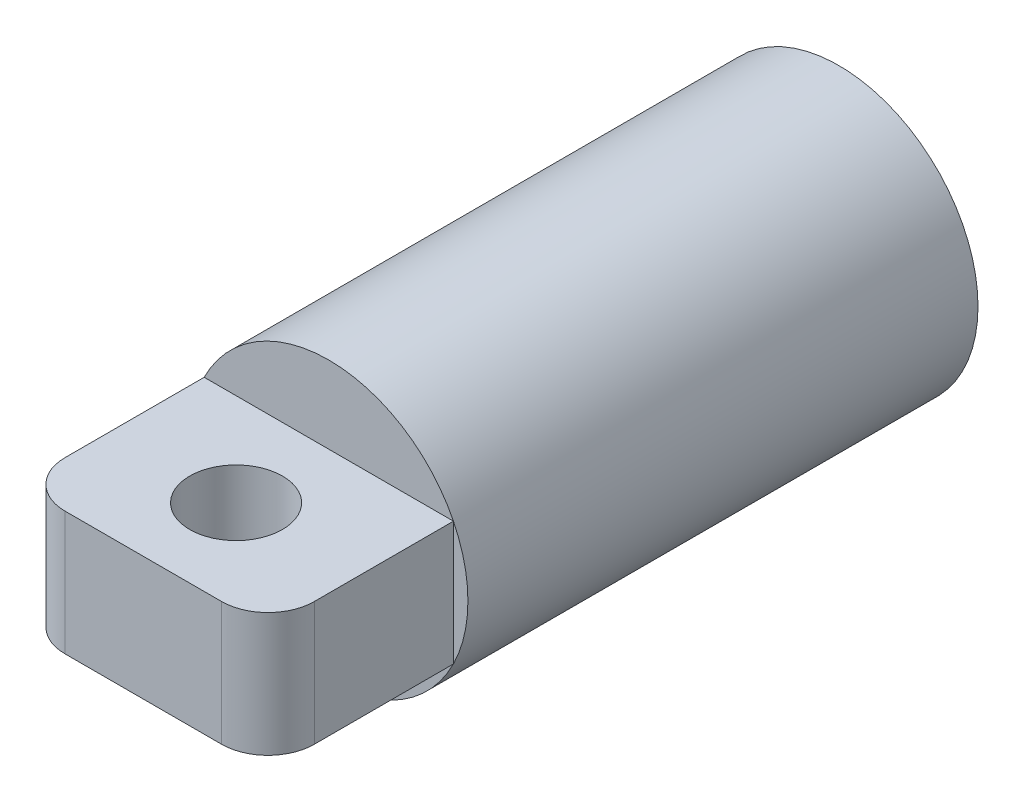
ISO-10303-21;
HEADER;
FILE_DESCRIPTION(('STEP AP214'),'2;1');
FILE_NAME('part.step','',(''),(''),'','','');
FILE_SCHEMA(('AUTOMOTIVE_DESIGN { 1 0 10303 214 1 1 1 1 }'));
ENDSEC;
DATA;
#1=APPLICATION_CONTEXT('core data for automotive mechanical design processes');
#2=APPLICATION_PROTOCOL_DEFINITION('international standard','automotive_design',2000,#1);
#3=PRODUCT_CONTEXT('',#1,'mechanical');
#4=PRODUCT('Part','Part','',(#3));
#5=PRODUCT_RELATED_PRODUCT_CATEGORY('part','',(#4));
#6=PRODUCT_DEFINITION_FORMATION('','',#4);
#7=PRODUCT_DEFINITION_CONTEXT('part definition',#1,'design');
#8=PRODUCT_DEFINITION('design','',#6,#7);
#9=PRODUCT_DEFINITION_SHAPE('','',#8);
#10=(LENGTH_UNIT() NAMED_UNIT(*) SI_UNIT(.MILLI.,.METRE.));
#11=(NAMED_UNIT(*) PLANE_ANGLE_UNIT() SI_UNIT($,.RADIAN.));
#12=(NAMED_UNIT(*) SI_UNIT($,.STERADIAN.) SOLID_ANGLE_UNIT());
#13=UNCERTAINTY_MEASURE_WITH_UNIT(LENGTH_MEASURE(1.E-05),#10,'distance_accuracy_value','');
#14=(GEOMETRIC_REPRESENTATION_CONTEXT(3) GLOBAL_UNCERTAINTY_ASSIGNED_CONTEXT((#13)) GLOBAL_UNIT_ASSIGNED_CONTEXT((#10,
#11,#12)) REPRESENTATION_CONTEXT('',''));
#15=CARTESIAN_POINT('',(0.,0.,0.));
#16=DIRECTION('',(0.,0.,1.));
#17=DIRECTION('',(1.,0.,0.));
#18=AXIS2_PLACEMENT_3D('',#15,#16,#17);
#19=CARTESIAN_POINT('',(0.,0.,45.));
#20=DIRECTION('',(0.,0.,-1.));
#21=DIRECTION('',(-1.,0.,0.));
#22=AXIS2_PLACEMENT_3D('',#19,#20,#21);
#23=CYLINDRICAL_SURFACE('',#22,9.);
#24=CARTESIAN_POINT('',(0.,0.,0.));
#25=DIRECTION('',(0.,0.,1.));
#26=DIRECTION('',(1.,0.,0.));
#27=AXIS2_PLACEMENT_3D('',#24,#25,#26);
#28=CIRCLE('',#27,9.);
#29=CARTESIAN_POINT('',(9.,0.,0.));
#30=VERTEX_POINT('',#29);
#31=EDGE_CURVE('E129',#30,#30,#28,.T.);
#32=ORIENTED_EDGE('',*,*,#31,.T.);
#33=EDGE_LOOP('',(#32));
#34=FACE_BOUND('',#33,.T.);
#35=CARTESIAN_POINT('',(0.,0.,33.));
#36=DIRECTION('',(0.,0.,1.));
#37=DIRECTION('',(1.,0.,0.));
#38=AXIS2_PLACEMENT_3D('',#35,#36,#37);
#39=CIRCLE('',#38,9.);
#40=CARTESIAN_POINT('',(8.06225774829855,4.,33.));
#41=VERTEX_POINT('',#40);
#42=CARTESIAN_POINT('',(-8.06225774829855,4.,33.));
#43=VERTEX_POINT('',#42);
#44=EDGE_CURVE('E97',#41,#43,#39,.T.);
#45=ORIENTED_EDGE('',*,*,#44,.F.);
#46=CARTESIAN_POINT('',(8.06225774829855,-4.,33.));
#47=VERTEX_POINT('',#46);
#48=EDGE_CURVE('E89',#47,#41,#39,.T.);
#49=ORIENTED_EDGE('',*,*,#48,.F.);
#50=CARTESIAN_POINT('',(-8.06225774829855,-4.,33.));
#51=VERTEX_POINT('',#50);
#52=EDGE_CURVE('E98',#51,#47,#39,.T.);
#53=ORIENTED_EDGE('',*,*,#52,.F.);
#54=EDGE_CURVE('E123',#43,#51,#39,.T.);
#55=ORIENTED_EDGE('',*,*,#54,.F.);
#56=EDGE_LOOP('',(#45,#49,#53,#55));
#57=FACE_BOUND('',#56,.T.);
#58=ADVANCED_FACE('F34',(#34,#57),#23,.T.);
#59=CARTESIAN_POINT('',(0.,0.,0.));
#60=DIRECTION('',(0.,0.,1.));
#61=DIRECTION('',(1.,0.,0.));
#62=AXIS2_PLACEMENT_3D('',#59,#60,#61);
#63=PLANE('',#62);
#64=ORIENTED_EDGE('',*,*,#31,.F.);
#65=EDGE_LOOP('',(#64));
#66=FACE_BOUND('',#65,.T.);
#67=ADVANCED_FACE('F197',(#66),#63,.F.);
#68=CARTESIAN_POINT('',(0.,0.,33.));
#69=DIRECTION('',(0.,0.,1.));
#70=DIRECTION('',(1.,0.,0.));
#71=AXIS2_PLACEMENT_3D('',#68,#69,#70);
#72=PLANE('',#71);
#73=ORIENTED_EDGE('',*,*,#44,.T.);
#74=DIRECTION('',(-1.,0.,0.));
#75=VECTOR('',#74,1.);
#76=CARTESIAN_POINT('',(-8.06225774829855,4.,33.));
#77=LINE('',#76,#75);
#78=EDGE_CURVE('E107',#41,#43,#77,.T.);
#79=ORIENTED_EDGE('',*,*,#78,.F.);
#80=EDGE_LOOP('',(#73,#79));
#81=FACE_BOUND('',#80,.T.);
#82=ADVANCED_FACE('F114',(#81),#72,.T.);
#83=ORIENTED_EDGE('',*,*,#54,.T.);
#84=DIRECTION('',(0.,-1.,0.));
#85=VECTOR('',#84,1.);
#86=CARTESIAN_POINT('',(-8.06225774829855,-4.,33.));
#87=LINE('',#86,#85);
#88=EDGE_CURVE('E116',#43,#51,#87,.T.);
#89=ORIENTED_EDGE('',*,*,#88,.F.);
#90=EDGE_LOOP('',(#83,#89));
#91=FACE_BOUND('',#90,.T.);
#92=ADVANCED_FACE('F188',(#91),#72,.T.);
#93=ORIENTED_EDGE('',*,*,#52,.T.);
#94=DIRECTION('',(1.,0.,0.));
#95=VECTOR('',#94,1.);
#96=CARTESIAN_POINT('',(-8.06225774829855,-4.,33.));
#97=LINE('',#96,#95);
#98=EDGE_CURVE('E111',#51,#47,#97,.T.);
#99=ORIENTED_EDGE('',*,*,#98,.F.);
#100=EDGE_LOOP('',(#93,#99));
#101=FACE_BOUND('',#100,.T.);
#102=ADVANCED_FACE('F186',(#101),#72,.T.);
#103=ORIENTED_EDGE('',*,*,#48,.T.);
#104=DIRECTION('',(0.,1.,0.));
#105=VECTOR('',#104,1.);
#106=CARTESIAN_POINT('',(8.06225774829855,-4.,33.));
#107=LINE('',#106,#105);
#108=EDGE_CURVE('E93',#47,#41,#107,.T.);
#109=ORIENTED_EDGE('',*,*,#108,.F.);
#110=EDGE_LOOP('',(#103,#109));
#111=FACE_BOUND('',#110,.T.);
#112=ADVANCED_FACE('F91',(#111),#72,.T.);
#113=CARTESIAN_POINT('',(8.06225774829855,-4.,33.));
#114=DIRECTION('',(1.,0.,0.));
#115=DIRECTION('',(0.,0.,-1.));
#116=AXIS2_PLACEMENT_3D('',#113,#114,#115);
#117=PLANE('',#116);
#118=DIRECTION('',(0.,0.,1.));
#119=VECTOR('',#118,1.);
#120=CARTESIAN_POINT('',(8.06225774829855,4.,33.));
#121=LINE('',#120,#119);
#122=CARTESIAN_POINT('',(8.06225774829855,4.,42.));
#123=VERTEX_POINT('',#122);
#124=EDGE_CURVE('E102',#41,#123,#121,.T.);
#125=ORIENTED_EDGE('',*,*,#124,.T.);
#126=DIRECTION('',(0.,1.,0.));
#127=VECTOR('',#126,1.);
#128=CARTESIAN_POINT('',(8.06225774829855,-4.,42.));
#129=LINE('',#128,#127);
#130=CARTESIAN_POINT('',(8.06225774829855,-4.,42.));
#131=VERTEX_POINT('',#130);
#132=EDGE_CURVE('E57',#123,#131,#129,.F.);
#133=ORIENTED_EDGE('',*,*,#132,.T.);
#134=DIRECTION('',(0.,0.,1.));
#135=VECTOR('',#134,1.);
#136=CARTESIAN_POINT('',(8.06225774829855,-4.,33.));
#137=LINE('',#136,#135);
#138=EDGE_CURVE('E119',#47,#131,#137,.T.);
#139=ORIENTED_EDGE('',*,*,#138,.F.);
#140=ORIENTED_EDGE('',*,*,#108,.T.);
#141=EDGE_LOOP('',(#125,#133,#139,#140));
#142=FACE_BOUND('',#141,.T.);
#143=ADVANCED_FACE('F118',(#142),#117,.T.);
#144=CARTESIAN_POINT('',(-8.06225774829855,-4.,33.));
#145=DIRECTION('',(0.,-1.,0.));
#146=DIRECTION('',(0.,0.,-1.));
#147=AXIS2_PLACEMENT_3D('',#144,#145,#146);
#148=PLANE('',#147);
#149=CARTESIAN_POINT('',(0.,-4.,39.));
#150=DIRECTION('',(0.,-1.,0.));
#151=DIRECTION('',(0.,0.,-1.));
#152=AXIS2_PLACEMENT_3D('',#149,#150,#151);
#153=CIRCLE('',#152,3.);
#154=CARTESIAN_POINT('',(0.,-4.,36.));
#155=VERTEX_POINT('',#154);
#156=EDGE_CURVE('E148',#155,#155,#153,.T.);
#157=ORIENTED_EDGE('',*,*,#156,.F.);
#158=EDGE_LOOP('',(#157));
#159=FACE_BOUND('',#158,.T.);
#160=ORIENTED_EDGE('',*,*,#138,.T.);
#161=CARTESIAN_POINT('',(5.06225774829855,-4.,42.));
#162=DIRECTION('',(0.,-1.,0.));
#163=DIRECTION('',(0.,0.,-1.));
#164=AXIS2_PLACEMENT_3D('',#161,#162,#163);
#165=CIRCLE('',#164,3.);
#166=CARTESIAN_POINT('',(5.06225774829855,-4.,45.));
#167=VERTEX_POINT('',#166);
#168=EDGE_CURVE('E42',#131,#167,#165,.T.);
#169=ORIENTED_EDGE('',*,*,#168,.T.);
#170=DIRECTION('',(1.,0.,0.));
#171=VECTOR('',#170,1.);
#172=CARTESIAN_POINT('',(-8.06225774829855,-4.,45.));
#173=LINE('',#172,#171);
#174=CARTESIAN_POINT('',(-5.06225774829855,-4.,45.));
#175=VERTEX_POINT('',#174);
#176=EDGE_CURVE('E121',#175,#167,#173,.T.);
#177=ORIENTED_EDGE('',*,*,#176,.F.);
#178=CARTESIAN_POINT('',(-5.06225774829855,-4.,42.));
#179=DIRECTION('',(0.,-1.,0.));
#180=DIRECTION('',(0.,0.,-1.));
#181=AXIS2_PLACEMENT_3D('',#178,#179,#180);
#182=CIRCLE('',#181,3.);
#183=CARTESIAN_POINT('',(-8.06225774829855,-4.,42.));
#184=VERTEX_POINT('',#183);
#185=EDGE_CURVE('E49',#175,#184,#182,.T.);
#186=ORIENTED_EDGE('',*,*,#185,.T.);
#187=DIRECTION('',(0.,0.,1.));
#188=VECTOR('',#187,1.);
#189=CARTESIAN_POINT('',(-8.06225774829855,-4.,33.));
#190=LINE('',#189,#188);
#191=EDGE_CURVE('E134',#51,#184,#190,.T.);
#192=ORIENTED_EDGE('',*,*,#191,.F.);
#193=ORIENTED_EDGE('',*,*,#98,.T.);
#194=EDGE_LOOP('',(#160,#169,#177,#186,#192,#193));
#195=FACE_BOUND('',#194,.T.);
#196=ADVANCED_FACE('F161',(#159,#195),#148,.T.);
#197=CARTESIAN_POINT('',(-8.06225774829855,-4.,33.));
#198=DIRECTION('',(-1.,0.,0.));
#199=DIRECTION('',(0.,0.,1.));
#200=AXIS2_PLACEMENT_3D('',#197,#198,#199);
#201=PLANE('',#200);
#202=ORIENTED_EDGE('',*,*,#191,.T.);
#203=DIRECTION('',(0.,-1.,0.));
#204=VECTOR('',#203,1.);
#205=CARTESIAN_POINT('',(-8.06225774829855,-4.,42.));
#206=LINE('',#205,#204);
#207=CARTESIAN_POINT('',(-8.06225774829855,4.,42.));
#208=VERTEX_POINT('',#207);
#209=EDGE_CURVE('E12',#184,#208,#206,.F.);
#210=ORIENTED_EDGE('',*,*,#209,.T.);
#211=DIRECTION('',(0.,0.,1.));
#212=VECTOR('',#211,1.);
#213=CARTESIAN_POINT('',(-8.06225774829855,4.,33.));
#214=LINE('',#213,#212);
#215=EDGE_CURVE('E110',#43,#208,#214,.T.);
#216=ORIENTED_EDGE('',*,*,#215,.F.);
#217=ORIENTED_EDGE('',*,*,#88,.T.);
#218=EDGE_LOOP('',(#202,#210,#216,#217));
#219=FACE_BOUND('',#218,.T.);
#220=ADVANCED_FACE('F163',(#219),#201,.T.);
#221=CARTESIAN_POINT('',(-8.06225774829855,4.,33.));
#222=DIRECTION('',(0.,1.,0.));
#223=DIRECTION('',(0.,0.,1.));
#224=AXIS2_PLACEMENT_3D('',#221,#222,#223);
#225=PLANE('',#224);
#226=CARTESIAN_POINT('',(0.,4.,39.));
#227=DIRECTION('',(0.,-1.,0.));
#228=DIRECTION('',(0.,0.,-1.));
#229=AXIS2_PLACEMENT_3D('',#226,#227,#228);
#230=CIRCLE('',#229,3.);
#231=CARTESIAN_POINT('',(0.,4.,36.));
#232=VERTEX_POINT('',#231);
#233=EDGE_CURVE('E144',#232,#232,#230,.T.);
#234=ORIENTED_EDGE('',*,*,#233,.T.);
#235=EDGE_LOOP('',(#234));
#236=FACE_BOUND('',#235,.T.);
#237=DIRECTION('',(-1.,0.,0.));
#238=VECTOR('',#237,1.);
#239=CARTESIAN_POINT('',(-8.06225774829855,4.,45.));
#240=LINE('',#239,#238);
#241=CARTESIAN_POINT('',(5.06225774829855,4.,45.));
#242=VERTEX_POINT('',#241);
#243=CARTESIAN_POINT('',(-5.06225774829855,4.,45.));
#244=VERTEX_POINT('',#243);
#245=EDGE_CURVE('E141',#242,#244,#240,.T.);
#246=ORIENTED_EDGE('',*,*,#245,.F.);
#247=CARTESIAN_POINT('',(5.06225774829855,4.,42.));
#248=DIRECTION('',(0.,1.,0.));
#249=DIRECTION('',(0.,0.,1.));
#250=AXIS2_PLACEMENT_3D('',#247,#248,#249);
#251=CIRCLE('',#250,3.);
#252=EDGE_CURVE('E109',#242,#123,#251,.T.);
#253=ORIENTED_EDGE('',*,*,#252,.T.);
#254=ORIENTED_EDGE('',*,*,#124,.F.);
#255=ORIENTED_EDGE('',*,*,#78,.T.);
#256=ORIENTED_EDGE('',*,*,#215,.T.);
#257=CARTESIAN_POINT('',(-5.06225774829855,4.,42.));
#258=DIRECTION('',(0.,1.,0.));
#259=DIRECTION('',(0.,0.,1.));
#260=AXIS2_PLACEMENT_3D('',#257,#258,#259);
#261=CIRCLE('',#260,3.);
#262=EDGE_CURVE('E175',#208,#244,#261,.T.);
#263=ORIENTED_EDGE('',*,*,#262,.T.);
#264=EDGE_LOOP('',(#246,#253,#254,#255,#256,#263));
#265=FACE_BOUND('',#264,.T.);
#266=ADVANCED_FACE('F105',(#236,#265),#225,.T.);
#267=CARTESIAN_POINT('',(0.,0.,45.));
#268=DIRECTION('',(0.,0.,1.));
#269=DIRECTION('',(1.,0.,0.));
#270=AXIS2_PLACEMENT_3D('',#267,#268,#269);
#271=PLANE('',#270);
#272=ORIENTED_EDGE('',*,*,#176,.T.);
#273=DIRECTION('',(0.,1.,0.));
#274=VECTOR('',#273,1.);
#275=CARTESIAN_POINT('',(5.06225774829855,0.,45.));
#276=LINE('',#275,#274);
#277=EDGE_CURVE('E126',#167,#242,#276,.T.);
#278=ORIENTED_EDGE('',*,*,#277,.T.);
#279=ORIENTED_EDGE('',*,*,#245,.T.);
#280=DIRECTION('',(0.,-1.,0.));
#281=VECTOR('',#280,1.);
#282=CARTESIAN_POINT('',(-5.06225774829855,0.,45.));
#283=LINE('',#282,#281);
#284=EDGE_CURVE('E124',#244,#175,#283,.T.);
#285=ORIENTED_EDGE('',*,*,#284,.T.);
#286=EDGE_LOOP('',(#272,#278,#279,#285));
#287=FACE_BOUND('',#286,.T.);
#288=ADVANCED_FACE('F178',(#287),#271,.T.);
#289=CARTESIAN_POINT('',(5.06225774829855,0.,42.));
#290=DIRECTION('',(0.,1.,0.));
#291=DIRECTION('',(0.,0.,1.));
#292=AXIS2_PLACEMENT_3D('',#289,#290,#291);
#293=CYLINDRICAL_SURFACE('',#292,3.);
#294=ORIENTED_EDGE('',*,*,#168,.F.);
#295=ORIENTED_EDGE('',*,*,#132,.F.);
#296=ORIENTED_EDGE('',*,*,#252,.F.);
#297=ORIENTED_EDGE('',*,*,#277,.F.);
#298=EDGE_LOOP('',(#294,#295,#296,#297));
#299=FACE_BOUND('',#298,.T.);
#300=ADVANCED_FACE('F169',(#299),#293,.T.);
#301=CARTESIAN_POINT('',(-5.06225774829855,0.,42.));
#302=DIRECTION('',(0.,-1.,0.));
#303=DIRECTION('',(0.,0.,-1.));
#304=AXIS2_PLACEMENT_3D('',#301,#302,#303);
#305=CYLINDRICAL_SURFACE('',#304,3.);
#306=ORIENTED_EDGE('',*,*,#262,.F.);
#307=ORIENTED_EDGE('',*,*,#209,.F.);
#308=ORIENTED_EDGE('',*,*,#185,.F.);
#309=ORIENTED_EDGE('',*,*,#284,.F.);
#310=EDGE_LOOP('',(#306,#307,#308,#309));
#311=FACE_BOUND('',#310,.T.);
#312=ADVANCED_FACE('F36',(#311),#305,.T.);
#313=CARTESIAN_POINT('',(0.,4.,39.));
#314=DIRECTION('',(0.,-1.,0.));
#315=DIRECTION('',(0.,0.,-1.));
#316=AXIS2_PLACEMENT_3D('',#313,#314,#315);
#317=CYLINDRICAL_SURFACE('',#316,3.);
#318=ORIENTED_EDGE('',*,*,#233,.F.);
#319=EDGE_LOOP('',(#318));
#320=FACE_BOUND('',#319,.T.);
#321=ORIENTED_EDGE('',*,*,#156,.T.);
#322=EDGE_LOOP('',(#321));
#323=FACE_BOUND('',#322,.T.);
#324=ADVANCED_FACE('F155',(#320,#323),#317,.F.);
#325=CLOSED_SHELL('',(#58,#67,#82,#92,#102,#112,#143,#196,#220,#266,#288,#300,#312,#324));
#326=MANIFOLD_SOLID_BREP('B2',#325);
#327=ADVANCED_BREP_SHAPE_REPRESENTATION('',(#18,#326),#14);
#328=SHAPE_DEFINITION_REPRESENTATION(#9,#327);
ENDSEC;
END-ISO-10303-21;
